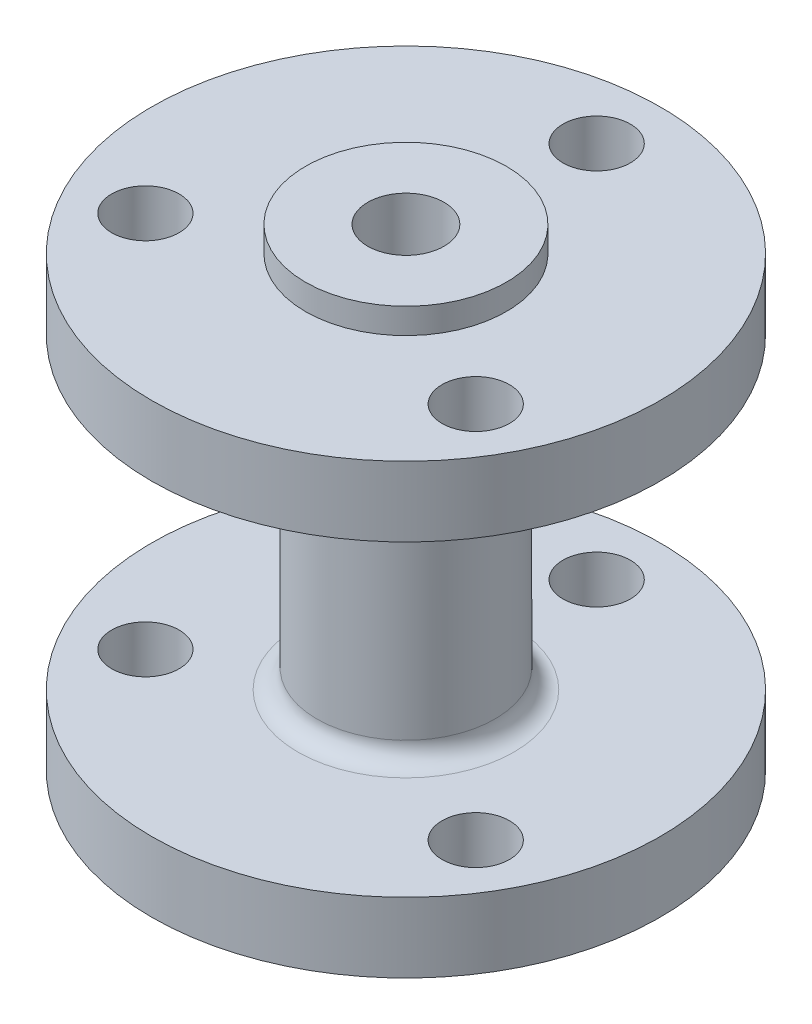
from build123d import *

# Parameters (mm, degrees)
F_6_0MM_DOWEL_HOLE1_D = 6
M5_CLEARANCE_HOLE1_D  = 5.3
CIRPATTERN1_COUNT     = 3
FILLET1_R             = 1.5


with BuildPart() as part:
    # Sketch2 → Revolve1 (revolve)
    with BuildSketch(Plane(origin=(0, 0, 0), x_dir=(0, 0, -1), z_dir=(1, 0, 0))):
        Polygon((0, 19.6), (-7.9, 19.6), (-7.9, 17.6), (-20, 17.6), (-20, 12.1), (-7, 12.1), (-7, -12.1), (-20, -12.1), (-20, -17.6), (-7.9, -17.6), (-7.9, -19.6), (0, -19.6), align=None)
    revolve(axis=Axis((0, 50, 0), (0, -1, 0)))

    # 6.0mm Dowel Hole1 (through all)
    with Locations(Plane(origin=(0, 19.6, 0), x_dir=(1, 0, 0), z_dir=(0, 1, 0))):
        with Locations((0, 0)):
            Hole(F_6_0MM_DOWEL_HOLE1_D / 2)

    # M5 Clearance Hole1 (through all)
    with Locations(Plane(origin=(0, 17.6, 0), x_dir=(1, 0, 0), z_dir=(0, 1, 0))):
        with Locations((0, 15)):
            m5_clearance_hole1 = Hole(M5_CLEARANCE_HOLE1_D / 2)

    # CirPattern1: M5 Clearance Hole1 ×3 about axis
    cirpattern1_axis = Axis((0, 50, 0), (0, -1, 0))
    for i in range(1, CIRPATTERN1_COUNT):
        add(m5_clearance_hole1.rotate(cirpattern1_axis, i * 360 / CIRPATTERN1_COUNT), mode=Mode.SUBTRACT)

    # Fillet1
    fillet1_edges = [part.edges().sort_by_distance(p)[0] for p in [
        (0, 12.1, -7),
        (0, -12.1, -7),
    ]]
    fillet(fillet1_edges, radius=FILLET1_R)


solid = part.part
